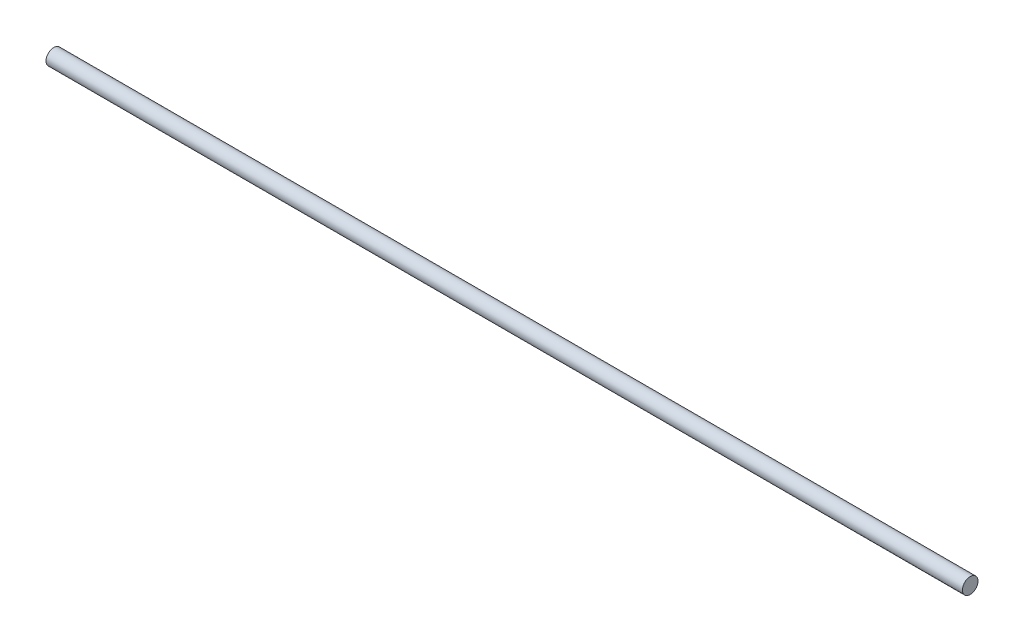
ISO-10303-21;
HEADER;
FILE_DESCRIPTION(('STEP AP214'),'2;1');
FILE_NAME('part.step','',(''),(''),'','','');
FILE_SCHEMA(('AUTOMOTIVE_DESIGN { 1 0 10303 214 1 1 1 1 }'));
ENDSEC;
DATA;
#1=APPLICATION_CONTEXT('core data for automotive mechanical design processes');
#2=APPLICATION_PROTOCOL_DEFINITION('international standard','automotive_design',2000,#1);
#3=PRODUCT_CONTEXT('',#1,'mechanical');
#4=PRODUCT('Part','Part','',(#3));
#5=PRODUCT_RELATED_PRODUCT_CATEGORY('part','',(#4));
#6=PRODUCT_DEFINITION_FORMATION('','',#4);
#7=PRODUCT_DEFINITION_CONTEXT('part definition',#1,'design');
#8=PRODUCT_DEFINITION('design','',#6,#7);
#9=PRODUCT_DEFINITION_SHAPE('','',#8);
#10=(LENGTH_UNIT() NAMED_UNIT(*) SI_UNIT(.MILLI.,.METRE.));
#11=(NAMED_UNIT(*) PLANE_ANGLE_UNIT() SI_UNIT($,.RADIAN.));
#12=(NAMED_UNIT(*) SI_UNIT($,.STERADIAN.) SOLID_ANGLE_UNIT());
#13=UNCERTAINTY_MEASURE_WITH_UNIT(LENGTH_MEASURE(1.E-05),#10,'distance_accuracy_value','');
#14=(GEOMETRIC_REPRESENTATION_CONTEXT(3) GLOBAL_UNCERTAINTY_ASSIGNED_CONTEXT((#13)) GLOBAL_UNIT_ASSIGNED_CONTEXT((#10,
#11,#12)) REPRESENTATION_CONTEXT('',''));
#15=CARTESIAN_POINT('',(0.,0.,0.));
#16=DIRECTION('',(0.,0.,1.));
#17=DIRECTION('',(1.,0.,0.));
#18=AXIS2_PLACEMENT_3D('',#15,#16,#17);
#19=CARTESIAN_POINT('',(235.,0.,0.));
#20=DIRECTION('',(-1.,0.,0.));
#21=DIRECTION('',(0.,0.,1.));
#22=AXIS2_PLACEMENT_3D('',#19,#20,#21);
#23=CYLINDRICAL_SURFACE('',#22,4.);
#24=CARTESIAN_POINT('',(235.,0.,0.));
#25=DIRECTION('',(1.,0.,0.));
#26=DIRECTION('',(0.,0.,-1.));
#27=AXIS2_PLACEMENT_3D('',#24,#25,#26);
#28=CIRCLE('',#27,4.);
#29=CARTESIAN_POINT('',(235.,0.,4.));
#30=VERTEX_POINT('',#29);
#31=EDGE_CURVE('E10',#30,#30,#28,.T.);
#32=CARTESIAN_POINT('',(-235.,0.,0.));
#33=DIRECTION('',(1.,0.,0.));
#34=DIRECTION('',(0.,0.,-1.));
#35=AXIS2_PLACEMENT_3D('',#32,#33,#34);
#36=CIRCLE('',#35,4.);
#37=CARTESIAN_POINT('',(-235.,0.,4.));
#38=VERTEX_POINT('',#37);
#39=EDGE_CURVE('E38',#38,#38,#36,.T.);
#40=CARTESIAN_POINT('',(235.,0.,4.));
#41=CARTESIAN_POINT('',(230.104166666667,0.,4.));
#42=CARTESIAN_POINT('',(225.208333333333,0.,4.));
#43=CARTESIAN_POINT('',(215.416666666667,0.,4.));
#44=CARTESIAN_POINT('',(210.520833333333,0.,4.));
#45=CARTESIAN_POINT('',(200.729166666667,0.,4.));
#46=CARTESIAN_POINT('',(195.833333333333,0.,4.));
#47=CARTESIAN_POINT('',(186.041666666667,0.,4.));
#48=CARTESIAN_POINT('',(181.145833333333,0.,4.));
#49=CARTESIAN_POINT('',(171.354166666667,0.,4.));
#50=CARTESIAN_POINT('',(166.458333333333,0.,4.));
#51=CARTESIAN_POINT('',(156.666666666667,0.,4.));
#52=CARTESIAN_POINT('',(151.770833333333,0.,4.));
#53=CARTESIAN_POINT('',(141.979166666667,0.,4.));
#54=CARTESIAN_POINT('',(137.083333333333,0.,4.));
#55=CARTESIAN_POINT('',(127.291666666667,0.,4.));
#56=CARTESIAN_POINT('',(122.395833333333,0.,4.));
#57=CARTESIAN_POINT('',(112.604166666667,0.,4.));
#58=CARTESIAN_POINT('',(107.708333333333,0.,4.));
#59=CARTESIAN_POINT('',(97.9166666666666,0.,4.));
#60=CARTESIAN_POINT('',(93.0208333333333,0.,4.));
#61=CARTESIAN_POINT('',(83.2291666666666,0.,4.));
#62=CARTESIAN_POINT('',(78.3333333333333,0.,4.));
#63=CARTESIAN_POINT('',(68.5416666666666,0.,4.));
#64=CARTESIAN_POINT('',(63.6458333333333,0.,4.));
#65=CARTESIAN_POINT('',(53.8541666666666,0.,4.));
#66=CARTESIAN_POINT('',(48.9583333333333,0.,4.));
#67=CARTESIAN_POINT('',(39.1666666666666,0.,4.));
#68=CARTESIAN_POINT('',(34.2708333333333,0.,4.));
#69=CARTESIAN_POINT('',(24.4791666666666,0.,4.));
#70=CARTESIAN_POINT('',(19.5833333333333,0.,4.));
#71=CARTESIAN_POINT('',(9.79166666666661,0.,4.));
#72=CARTESIAN_POINT('',(4.89583333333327,0.,4.));
#73=CARTESIAN_POINT('',(-4.89583333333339,0.,4.));
#74=CARTESIAN_POINT('',(-9.79166666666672,0.,4.));
#75=CARTESIAN_POINT('',(-19.5833333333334,0.,4.));
#76=CARTESIAN_POINT('',(-24.4791666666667,0.,4.));
#77=CARTESIAN_POINT('',(-34.2708333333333,0.,4.));
#78=CARTESIAN_POINT('',(-39.1666666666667,0.,4.));
#79=CARTESIAN_POINT('',(-48.9583333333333,0.,4.));
#80=CARTESIAN_POINT('',(-53.8541666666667,0.,4.));
#81=CARTESIAN_POINT('',(-63.6458333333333,0.,4.));
#82=CARTESIAN_POINT('',(-68.5416666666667,0.,4.));
#83=CARTESIAN_POINT('',(-78.3333333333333,0.,4.));
#84=CARTESIAN_POINT('',(-83.2291666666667,0.,4.));
#85=CARTESIAN_POINT('',(-93.0208333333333,0.,4.));
#86=CARTESIAN_POINT('',(-97.9166666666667,0.,4.));
#87=CARTESIAN_POINT('',(-107.708333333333,0.,4.));
#88=CARTESIAN_POINT('',(-112.604166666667,0.,4.));
#89=CARTESIAN_POINT('',(-122.395833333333,0.,4.));
#90=CARTESIAN_POINT('',(-127.291666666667,0.,4.));
#91=CARTESIAN_POINT('',(-137.083333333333,0.,4.));
#92=CARTESIAN_POINT('',(-141.979166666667,0.,4.));
#93=CARTESIAN_POINT('',(-151.770833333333,0.,4.));
#94=CARTESIAN_POINT('',(-156.666666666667,0.,4.));
#95=CARTESIAN_POINT('',(-166.458333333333,0.,4.));
#96=CARTESIAN_POINT('',(-171.354166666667,0.,4.));
#97=CARTESIAN_POINT('',(-181.145833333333,0.,4.));
#98=CARTESIAN_POINT('',(-186.041666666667,0.,4.));
#99=CARTESIAN_POINT('',(-195.833333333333,0.,4.));
#100=CARTESIAN_POINT('',(-200.729166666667,0.,4.));
#101=CARTESIAN_POINT('',(-210.520833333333,0.,4.));
#102=CARTESIAN_POINT('',(-215.416666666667,0.,4.));
#103=CARTESIAN_POINT('',(-225.208333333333,0.,4.));
#104=CARTESIAN_POINT('',(-230.104166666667,0.,4.));
#105=CARTESIAN_POINT('',(-235.,0.,4.));
#106=B_SPLINE_CURVE_WITH_KNOTS('',3,(#40,#41,#42,#43,#44,#45,#46,#47,#48,#49,#50,#51,#52,#53,
#54,#55,#56,#57,#58,#59,#60,#61,#62,#63,#64,#65,#66,#67,#68,#69,#70,#71,#72,#73,#74,#75,#76,#77,
#78,#79,#80,#81,#82,#83,#84,#85,#86,#87,#88,#89,#90,#91,#92,#93,#94,#95,#96,#97,#98,#99,#100,
#101,#102,#103,#104,#105),.UNSPECIFIED.,.F.,.F.,(4,2,2,2,2,2,2,2,2,2,2,2,2,2,2,2,2,2,2,2,2,2,2,
2,2,2,2,2,2,2,2,2,4),(0.,14.6875,29.375,44.0625,58.75,73.4375,88.125,102.8125,117.5,132.1875,
146.875,161.5625,176.25,190.9375,205.625,220.3125,235.,249.6875,264.375,279.0625,293.75,
308.4375,323.125,337.8125,352.5,367.1875,381.875,396.5625,411.25,425.9375,440.625,455.3125,
470.),.UNSPECIFIED.);
#107=EDGE_CURVE('BSEAM35',#30,#38,#106,.T.);
#108=ORIENTED_EDGE('',*,*,#31,.F.);
#109=ORIENTED_EDGE('',*,*,#39,.T.);
#110=ORIENTED_EDGE('',*,*,#107,.T.);
#111=ORIENTED_EDGE('',*,*,#107,.F.);
#112=EDGE_LOOP('',(#108,#110,#109,#111));
#113=FACE_BOUND('',#112,.T.);
#114=ADVANCED_FACE('F35',(#113),#23,.T.);
#115=CARTESIAN_POINT('',(235.,0.,0.));
#116=DIRECTION('',(1.,0.,0.));
#117=DIRECTION('',(0.,0.,-1.));
#118=AXIS2_PLACEMENT_3D('',#115,#116,#117);
#119=PLANE('',#118);
#120=ORIENTED_EDGE('',*,*,#31,.T.);
#121=EDGE_LOOP('',(#120));
#122=FACE_BOUND('',#121,.T.);
#123=ADVANCED_FACE('F54',(#122),#119,.T.);
#124=CARTESIAN_POINT('',(-235.,0.,0.));
#125=DIRECTION('',(1.,0.,0.));
#126=DIRECTION('',(0.,0.,-1.));
#127=AXIS2_PLACEMENT_3D('',#124,#125,#126);
#128=PLANE('',#127);
#129=ORIENTED_EDGE('',*,*,#39,.F.);
#130=EDGE_LOOP('',(#129));
#131=FACE_BOUND('',#130,.T.);
#132=ADVANCED_FACE('F52',(#131),#128,.F.);
#133=CLOSED_SHELL('',(#114,#123,#132));
#134=MANIFOLD_SOLID_BREP('B2',#133);
#135=ADVANCED_BREP_SHAPE_REPRESENTATION('',(#18,#134),#14);
#136=SHAPE_DEFINITION_REPRESENTATION(#9,#135);
ENDSEC;
END-ISO-10303-21;
